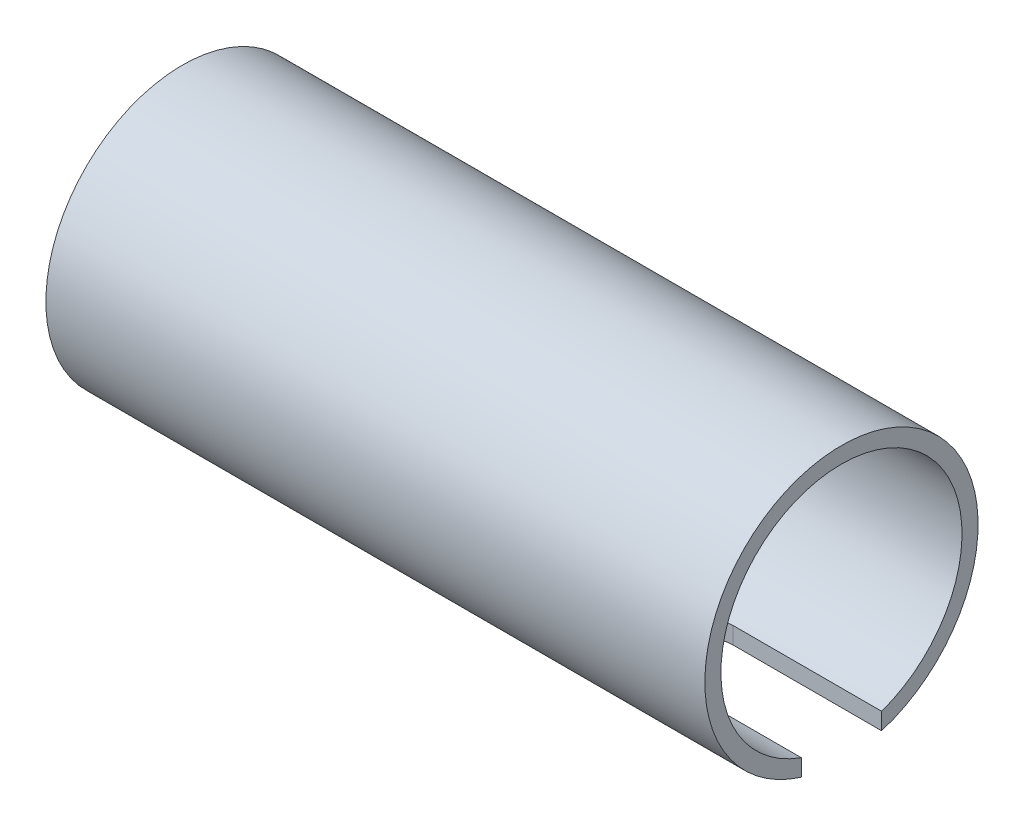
from build123d import *

# Parameters (mm, degrees)
ESQUISSE1_R             = 8.5
ESQUISSE1_R_2           = 7.5
BOSS_EXTRU_1_DEPTH      = 41
ENL_V_MAT_EXTRU_1_DEPTH = 10


with BuildPart() as part:
    # Esquisse1 → Boss.-Extru.1 (new body)
    with BuildSketch(Plane(origin=(0, 0, 0), x_dir=(0, 0, -1), z_dir=(1, 0, 0))):
        Circle(ESQUISSE1_R)
        Circle(ESQUISSE1_R_2, mode=Mode.SUBTRACT)
    extrude(amount=BOSS_EXTRU_1_DEPTH)

    # Esquisse2 → Enl_v. mat.-Extru.1 (cut)
    with BuildSketch(Plane(origin=(0, 0, 0), x_dir=(1, 0, 0), z_dir=(0, 1, 0))):
        with BuildLine():
            Line((46.029351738, -2.5), (31.745071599, -2.5))
            ThreePointArc((31.745071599, -2.5), (29.245071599, 0), (31.745071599, 2.5))
            Line((31.745071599, 2.5), (46.029351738, 2.5))
            ThreePointArc((46.029351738, 2.5), (48.529351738, 0), (46.029351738, -2.5))
        make_face()
    extrude(amount=-ENL_V_MAT_EXTRU_1_DEPTH, mode=Mode.SUBTRACT)


solid = part.part
